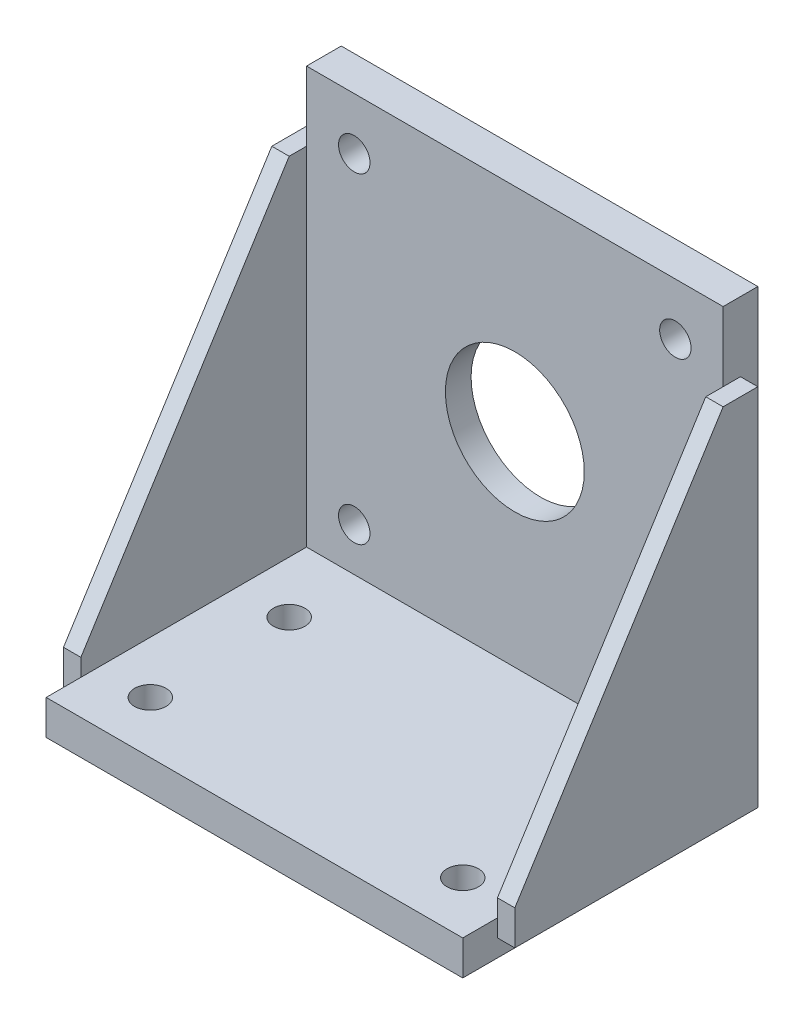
ISO-10303-21;
HEADER;
FILE_DESCRIPTION(('STEP AP214'),'2;1');
FILE_NAME('part.step','',(''),(''),'','','');
FILE_SCHEMA(('AUTOMOTIVE_DESIGN { 1 0 10303 214 1 1 1 1 }'));
ENDSEC;
DATA;
#1=APPLICATION_CONTEXT('core data for automotive mechanical design processes');
#2=APPLICATION_PROTOCOL_DEFINITION('international standard','automotive_design',2000,#1);
#3=PRODUCT_CONTEXT('',#1,'mechanical');
#4=PRODUCT('Part','Part','',(#3));
#5=PRODUCT_RELATED_PRODUCT_CATEGORY('part','',(#4));
#6=PRODUCT_DEFINITION_FORMATION('','',#4);
#7=PRODUCT_DEFINITION_CONTEXT('part definition',#1,'design');
#8=PRODUCT_DEFINITION('design','',#6,#7);
#9=PRODUCT_DEFINITION_SHAPE('','',#8);
#10=(LENGTH_UNIT() NAMED_UNIT(*) SI_UNIT(.MILLI.,.METRE.));
#11=(NAMED_UNIT(*) PLANE_ANGLE_UNIT() SI_UNIT($,.RADIAN.));
#12=(NAMED_UNIT(*) SI_UNIT($,.STERADIAN.) SOLID_ANGLE_UNIT());
#13=UNCERTAINTY_MEASURE_WITH_UNIT(LENGTH_MEASURE(1.E-05),#10,'distance_accuracy_value','');
#14=(GEOMETRIC_REPRESENTATION_CONTEXT(3) GLOBAL_UNCERTAINTY_ASSIGNED_CONTEXT((#13)) GLOBAL_UNIT_ASSIGNED_CONTEXT((#10,
#11,#12)) REPRESENTATION_CONTEXT('',''));
#15=CARTESIAN_POINT('',(0.,0.,0.));
#16=DIRECTION('',(0.,0.,1.));
#17=DIRECTION('',(1.,0.,0.));
#18=AXIS2_PLACEMENT_3D('',#15,#16,#17);
#19=CARTESIAN_POINT('',(-76.2,77.7875,12.7));
#20=DIRECTION('',(1.,0.,0.));
#21=DIRECTION('',(0.,1.,0.));
#22=AXIS2_PLACEMENT_3D('',#19,#20,#21);
#23=PLANE('',#22);
#24=DIRECTION('',(0.,0.,1.));
#25=VECTOR('',#24,1.);
#26=CARTESIAN_POINT('',(-76.2,-74.6125,6.35));
#27=LINE('',#26,#25);
#28=CARTESIAN_POINT('',(-76.2,-74.6125,95.25));
#29=VERTEX_POINT('',#28);
#30=CARTESIAN_POINT('',(-76.2,-74.6125,107.95));
#31=VERTEX_POINT('',#30);
#32=EDGE_CURVE('E211',#29,#31,#27,.T.);
#33=ORIENTED_EDGE('',*,*,#32,.F.);
#34=DIRECTION('',(0.,-1.,0.));
#35=VECTOR('',#34,1.);
#36=CARTESIAN_POINT('',(-76.2,-68.2625,95.25));
#37=LINE('',#36,#35);
#38=CARTESIAN_POINT('',(-76.2,-80.9625,95.25));
#39=VERTEX_POINT('',#38);
#40=EDGE_CURVE('E189',#29,#39,#37,.T.);
#41=ORIENTED_EDGE('',*,*,#40,.T.);
#42=DIRECTION('',(0.,0.,1.));
#43=VECTOR('',#42,1.);
#44=CARTESIAN_POINT('',(-76.2,-80.9625,6.35));
#45=LINE('',#44,#43);
#46=CARTESIAN_POINT('',(-76.2,-80.9625,6.35));
#47=VERTEX_POINT('',#46);
#48=EDGE_CURVE('E174',#47,#39,#45,.T.);
#49=ORIENTED_EDGE('',*,*,#48,.F.);
#50=DIRECTION('',(0.,-1.,0.));
#51=VECTOR('',#50,1.);
#52=CARTESIAN_POINT('',(-76.2,-74.6125,6.35));
#53=LINE('',#52,#51);
#54=CARTESIAN_POINT('',(-76.2,-87.3125,6.35));
#55=VERTEX_POINT('',#54);
#56=EDGE_CURVE('E187',#47,#55,#53,.T.);
#57=ORIENTED_EDGE('',*,*,#56,.T.);
#58=DIRECTION('',(0.,0.,-1.));
#59=VECTOR('',#58,1.);
#60=CARTESIAN_POINT('',(-76.2,-87.3125,107.95));
#61=LINE('',#60,#59);
#62=CARTESIAN_POINT('',(-76.2,-87.3125,107.95));
#63=VERTEX_POINT('',#62);
#64=EDGE_CURVE('E197',#63,#55,#61,.T.);
#65=ORIENTED_EDGE('',*,*,#64,.F.);
#66=DIRECTION('',(0.,1.,0.));
#67=VECTOR('',#66,1.);
#68=CARTESIAN_POINT('',(-76.2,-87.3125,107.95));
#69=LINE('',#68,#67);
#70=EDGE_CURVE('E200',#63,#31,#69,.T.);
#71=ORIENTED_EDGE('',*,*,#70,.T.);
#72=EDGE_LOOP('',(#33,#41,#49,#57,#65,#71));
#73=FACE_BOUND('',#72,.T.);
#74=ADVANCED_FACE('F32',(#73),#23,.F.);
#75=CARTESIAN_POINT('',(76.2,-74.6125,12.7));
#76=DIRECTION('',(-1.,0.,0.));
#77=DIRECTION('',(0.,0.,1.));
#78=AXIS2_PLACEMENT_3D('',#75,#76,#77);
#79=PLANE('',#78);
#80=DIRECTION('',(0.,0.,1.));
#81=VECTOR('',#80,1.);
#82=CARTESIAN_POINT('',(76.2,52.3875,6.35));
#83=LINE('',#82,#81);
#84=CARTESIAN_POINT('',(76.2,52.3875,6.35));
#85=VERTEX_POINT('',#84);
#86=CARTESIAN_POINT('',(76.2,52.3875,12.7));
#87=VERTEX_POINT('',#86);
#88=EDGE_CURVE('E55',#85,#87,#83,.T.);
#89=ORIENTED_EDGE('',*,*,#88,.F.);
#90=DIRECTION('',(0.,1.,0.));
#91=VECTOR('',#90,1.);
#92=CARTESIAN_POINT('',(76.2,-80.9625,6.35));
#93=LINE('',#92,#91);
#94=CARTESIAN_POINT('',(76.2,-74.6125,6.35));
#95=VERTEX_POINT('',#94);
#96=EDGE_CURVE('E235',#95,#85,#93,.T.);
#97=ORIENTED_EDGE('',*,*,#96,.F.);
#98=DIRECTION('',(0.,0.,-1.));
#99=VECTOR('',#98,1.);
#100=CARTESIAN_POINT('',(76.2,-74.6125,12.7));
#101=LINE('',#100,#99);
#102=CARTESIAN_POINT('',(76.2,-74.6125,0.));
#103=VERTEX_POINT('',#102);
#104=EDGE_CURVE('E320',#95,#103,#101,.T.);
#105=ORIENTED_EDGE('',*,*,#104,.T.);
#106=DIRECTION('',(0.,1.,0.));
#107=VECTOR('',#106,1.);
#108=CARTESIAN_POINT('',(76.2,-74.6125,0.));
#109=LINE('',#108,#107);
#110=CARTESIAN_POINT('',(76.2,77.7875,0.));
#111=VERTEX_POINT('',#110);
#112=EDGE_CURVE('E426',#103,#111,#109,.T.);
#113=ORIENTED_EDGE('',*,*,#112,.T.);
#114=DIRECTION('',(0.,0.,-1.));
#115=VECTOR('',#114,1.);
#116=CARTESIAN_POINT('',(76.2,77.7875,12.7));
#117=LINE('',#116,#115);
#118=CARTESIAN_POINT('',(76.2,77.7875,12.7));
#119=VERTEX_POINT('',#118);
#120=EDGE_CURVE('E419',#119,#111,#117,.T.);
#121=ORIENTED_EDGE('',*,*,#120,.F.);
#122=DIRECTION('',(0.,1.,0.));
#123=VECTOR('',#122,1.);
#124=CARTESIAN_POINT('',(76.2,-74.6125,12.7));
#125=LINE('',#124,#123);
#126=EDGE_CURVE('E348',#87,#119,#125,.T.);
#127=ORIENTED_EDGE('',*,*,#126,.F.);
#128=EDGE_LOOP('',(#89,#97,#105,#113,#121,#127));
#129=FACE_BOUND('',#128,.T.);
#130=ADVANCED_FACE('F292',(#129),#79,.F.);
#131=CARTESIAN_POINT('',(76.2,77.7875,12.7));
#132=DIRECTION('',(0.,-1.,0.));
#133=DIRECTION('',(1.,0.,0.));
#134=AXIS2_PLACEMENT_3D('',#131,#132,#133);
#135=PLANE('',#134);
#136=DIRECTION('',(-1.,0.,0.));
#137=VECTOR('',#136,1.);
#138=CARTESIAN_POINT('',(76.2,77.7875,0.));
#139=LINE('',#138,#137);
#140=CARTESIAN_POINT('',(-76.2,77.7875,0.));
#141=VERTEX_POINT('',#140);
#142=EDGE_CURVE('E337',#111,#141,#139,.T.);
#143=ORIENTED_EDGE('',*,*,#142,.T.);
#144=DIRECTION('',(0.,0.,-1.));
#145=VECTOR('',#144,1.);
#146=CARTESIAN_POINT('',(-76.2,77.7875,12.7));
#147=LINE('',#146,#145);
#148=CARTESIAN_POINT('',(-76.2,77.7875,12.7));
#149=VERTEX_POINT('',#148);
#150=EDGE_CURVE('E411',#149,#141,#147,.T.);
#151=ORIENTED_EDGE('',*,*,#150,.F.);
#152=DIRECTION('',(-1.,0.,0.));
#153=VECTOR('',#152,1.);
#154=CARTESIAN_POINT('',(76.2,77.7875,12.7));
#155=LINE('',#154,#153);
#156=EDGE_CURVE('E231',#119,#149,#155,.T.);
#157=ORIENTED_EDGE('',*,*,#156,.F.);
#158=ORIENTED_EDGE('',*,*,#120,.T.);
#159=EDGE_LOOP('',(#143,#151,#157,#158));
#160=FACE_BOUND('',#159,.T.);
#161=ADVANCED_FACE('F299',(#160),#135,.F.);
#162=DIRECTION('',(0.,1.,0.));
#163=VECTOR('',#162,1.);
#164=CARTESIAN_POINT('',(-76.2,-80.9625,6.35));
#165=LINE('',#164,#163);
#166=CARTESIAN_POINT('',(-76.2,-74.6125,6.35));
#167=VERTEX_POINT('',#166);
#168=CARTESIAN_POINT('',(-76.2,52.3875,6.35));
#169=VERTEX_POINT('',#168);
#170=EDGE_CURVE('E232',#167,#169,#165,.T.);
#171=ORIENTED_EDGE('',*,*,#170,.T.);
#172=DIRECTION('',(0.,0.,1.));
#173=VECTOR('',#172,1.);
#174=CARTESIAN_POINT('',(-76.2,52.3875,6.35));
#175=LINE('',#174,#173);
#176=CARTESIAN_POINT('',(-76.2,52.3875,12.7));
#177=VERTEX_POINT('',#176);
#178=EDGE_CURVE('E47',#169,#177,#175,.T.);
#179=ORIENTED_EDGE('',*,*,#178,.T.);
#180=DIRECTION('',(0.,-1.,0.));
#181=VECTOR('',#180,1.);
#182=CARTESIAN_POINT('',(-76.2,77.7875,12.7));
#183=LINE('',#182,#181);
#184=EDGE_CURVE('E219',#149,#177,#183,.T.);
#185=ORIENTED_EDGE('',*,*,#184,.F.);
#186=ORIENTED_EDGE('',*,*,#150,.T.);
#187=DIRECTION('',(0.,-1.,0.));
#188=VECTOR('',#187,1.);
#189=CARTESIAN_POINT('',(-76.2,77.7875,0.));
#190=LINE('',#189,#188);
#191=CARTESIAN_POINT('',(-76.2,-74.6125,0.));
#192=VERTEX_POINT('',#191);
#193=EDGE_CURVE('E413',#141,#192,#190,.T.);
#194=ORIENTED_EDGE('',*,*,#193,.T.);
#195=DIRECTION('',(0.,0.,-1.));
#196=VECTOR('',#195,1.);
#197=CARTESIAN_POINT('',(-76.2,-74.6125,12.7));
#198=LINE('',#197,#196);
#199=EDGE_CURVE('E315',#167,#192,#198,.T.);
#200=ORIENTED_EDGE('',*,*,#199,.F.);
#201=EDGE_LOOP('',(#171,#179,#185,#186,#194,#200));
#202=FACE_BOUND('',#201,.T.);
#203=ADVANCED_FACE('F294',(#202),#23,.F.);
#204=CARTESIAN_POINT('',(76.2,-74.6125,12.7));
#205=DIRECTION('',(0.,-1.,0.));
#206=DIRECTION('',(1.,0.,0.));
#207=AXIS2_PLACEMENT_3D('',#204,#205,#206);
#208=PLANE('',#207);
#209=DIRECTION('',(1.,0.,0.));
#210=VECTOR('',#209,1.);
#211=CARTESIAN_POINT('',(-76.2,-74.6125,6.35));
#212=LINE('',#211,#210);
#213=EDGE_CURVE('E317',#167,#95,#212,.T.);
#214=ORIENTED_EDGE('',*,*,#213,.F.);
#215=ORIENTED_EDGE('',*,*,#199,.T.);
#216=DIRECTION('',(-1.,0.,0.));
#217=VECTOR('',#216,1.);
#218=CARTESIAN_POINT('',(76.2,-74.6125,0.));
#219=LINE('',#218,#217);
#220=EDGE_CURVE('E422',#103,#192,#219,.T.);
#221=ORIENTED_EDGE('',*,*,#220,.F.);
#222=ORIENTED_EDGE('',*,*,#104,.F.);
#223=EDGE_LOOP('',(#214,#215,#221,#222));
#224=FACE_BOUND('',#223,.T.);
#225=ADVANCED_FACE('F305',(#224),#208,.T.);
#226=DIRECTION('',(0.,-1.,0.));
#227=VECTOR('',#226,1.);
#228=CARTESIAN_POINT('',(76.2,-74.6125,6.35));
#229=LINE('',#228,#227);
#230=CARTESIAN_POINT('',(76.2,-80.9625,6.35));
#231=VERTEX_POINT('',#230);
#232=CARTESIAN_POINT('',(76.2,-87.3125,6.35));
#233=VERTEX_POINT('',#232);
#234=EDGE_CURVE('E350',#231,#233,#229,.T.);
#235=ORIENTED_EDGE('',*,*,#234,.F.);
#236=DIRECTION('',(0.,0.,1.));
#237=VECTOR('',#236,1.);
#238=CARTESIAN_POINT('',(76.2,-80.9625,6.35));
#239=LINE('',#238,#237);
#240=CARTESIAN_POINT('',(76.2,-80.9625,95.25));
#241=VERTEX_POINT('',#240);
#242=EDGE_CURVE('E208',#231,#241,#239,.T.);
#243=ORIENTED_EDGE('',*,*,#242,.T.);
#244=DIRECTION('',(0.,-1.,0.));
#245=VECTOR('',#244,1.);
#246=CARTESIAN_POINT('',(76.2,-68.2625,95.25));
#247=LINE('',#246,#245);
#248=CARTESIAN_POINT('',(76.2,-74.6125,95.25));
#249=VERTEX_POINT('',#248);
#250=EDGE_CURVE('E356',#249,#241,#247,.T.);
#251=ORIENTED_EDGE('',*,*,#250,.F.);
#252=DIRECTION('',(0.,0.,1.));
#253=VECTOR('',#252,1.);
#254=CARTESIAN_POINT('',(76.2,-74.6125,6.35));
#255=LINE('',#254,#253);
#256=CARTESIAN_POINT('',(76.2,-74.6125,107.95));
#257=VERTEX_POINT('',#256);
#258=EDGE_CURVE('E203',#249,#257,#255,.T.);
#259=ORIENTED_EDGE('',*,*,#258,.T.);
#260=DIRECTION('',(0.,1.,0.));
#261=VECTOR('',#260,1.);
#262=CARTESIAN_POINT('',(76.2,-87.3125,107.95));
#263=LINE('',#262,#261);
#264=CARTESIAN_POINT('',(76.2,-87.3125,107.95));
#265=VERTEX_POINT('',#264);
#266=EDGE_CURVE('E342',#265,#257,#263,.T.);
#267=ORIENTED_EDGE('',*,*,#266,.F.);
#268=DIRECTION('',(0.,0.,-1.));
#269=VECTOR('',#268,1.);
#270=CARTESIAN_POINT('',(76.2,-87.3125,107.95));
#271=LINE('',#270,#269);
#272=EDGE_CURVE('E352',#265,#233,#271,.T.);
#273=ORIENTED_EDGE('',*,*,#272,.T.);
#274=EDGE_LOOP('',(#235,#243,#251,#259,#267,#273));
#275=FACE_BOUND('',#274,.T.);
#276=ADVANCED_FACE('F301',(#275),#79,.F.);
#277=CARTESIAN_POINT('',(-76.2,77.7875,12.7));
#278=DIRECTION('',(0.,0.,1.));
#279=DIRECTION('',(1.,0.,0.));
#280=AXIS2_PLACEMENT_3D('',#277,#278,#279);
#281=PLANE('',#280);
#282=CARTESIAN_POINT('',(58.7375,-58.7375,12.7));
#283=DIRECTION('',(0.,0.,1.));
#284=DIRECTION('',(1.,0.,0.));
#285=AXIS2_PLACEMENT_3D('',#282,#283,#284);
#286=CIRCLE('',#285,5.75436999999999);
#287=CARTESIAN_POINT('',(64.49187,-58.7375,12.7));
#288=VERTEX_POINT('',#287);
#289=EDGE_CURVE('E262',#288,#288,#286,.T.);
#290=ORIENTED_EDGE('',*,*,#289,.F.);
#291=EDGE_LOOP('',(#290));
#292=FACE_BOUND('',#291,.T.);
#293=CARTESIAN_POINT('',(58.7375,58.7375,12.7));
#294=DIRECTION('',(0.,0.,1.));
#295=DIRECTION('',(1.,0.,0.));
#296=AXIS2_PLACEMENT_3D('',#293,#294,#295);
#297=CIRCLE('',#296,5.75436999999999);
#298=CARTESIAN_POINT('',(64.49187,58.7375,12.7));
#299=VERTEX_POINT('',#298);
#300=EDGE_CURVE('E258',#299,#299,#297,.T.);
#301=ORIENTED_EDGE('',*,*,#300,.F.);
#302=EDGE_LOOP('',(#301));
#303=FACE_BOUND('',#302,.T.);
#304=CARTESIAN_POINT('',(-58.7375,58.7375,12.7));
#305=DIRECTION('',(0.,0.,1.));
#306=DIRECTION('',(1.,0.,0.));
#307=AXIS2_PLACEMENT_3D('',#304,#305,#306);
#308=CIRCLE('',#307,5.75436999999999);
#309=CARTESIAN_POINT('',(-52.98313,58.7375,12.7));
#310=VERTEX_POINT('',#309);
#311=EDGE_CURVE('E254',#310,#310,#308,.T.);
#312=ORIENTED_EDGE('',*,*,#311,.F.);
#313=EDGE_LOOP('',(#312));
#314=FACE_BOUND('',#313,.T.);
#315=CARTESIAN_POINT('',(-58.7375,-58.7375,12.7));
#316=DIRECTION('',(0.,0.,1.));
#317=DIRECTION('',(1.,0.,0.));
#318=AXIS2_PLACEMENT_3D('',#315,#316,#317);
#319=CIRCLE('',#318,5.75436999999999);
#320=CARTESIAN_POINT('',(-52.98313,-58.7375,12.7));
#321=VERTEX_POINT('',#320);
#322=EDGE_CURVE('E250',#321,#321,#319,.T.);
#323=ORIENTED_EDGE('',*,*,#322,.F.);
#324=EDGE_LOOP('',(#323));
#325=FACE_BOUND('',#324,.T.);
#326=CARTESIAN_POINT('',(0.,0.,12.7));
#327=DIRECTION('',(0.,0.,1.));
#328=DIRECTION('',(1.,0.,0.));
#329=AXIS2_PLACEMENT_3D('',#326,#327,#328);
#330=CIRCLE('',#329,25.4);
#331=CARTESIAN_POINT('',(25.4,0.,12.7));
#332=VERTEX_POINT('',#331);
#333=EDGE_CURVE('E698',#332,#332,#330,.T.);
#334=ORIENTED_EDGE('',*,*,#333,.F.);
#335=EDGE_LOOP('',(#334));
#336=FACE_BOUND('',#335,.T.);
#337=ORIENTED_EDGE('',*,*,#156,.T.);
#338=ORIENTED_EDGE('',*,*,#184,.T.);
#339=CARTESIAN_POINT('',(-76.2,-74.6124999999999,12.7));
#340=VERTEX_POINT('',#339);
#341=EDGE_CURVE('E223',#177,#340,#183,.T.);
#342=ORIENTED_EDGE('',*,*,#341,.T.);
#343=DIRECTION('',(-1.,0.,0.));
#344=VECTOR('',#343,1.);
#345=CARTESIAN_POINT('',(76.2,-74.6125,12.7));
#346=LINE('',#345,#344);
#347=CARTESIAN_POINT('',(76.2,-74.6125,12.7));
#348=VERTEX_POINT('',#347);
#349=EDGE_CURVE('E222',#348,#340,#346,.T.);
#350=ORIENTED_EDGE('',*,*,#349,.F.);
#351=EDGE_CURVE('E431',#348,#87,#125,.T.);
#352=ORIENTED_EDGE('',*,*,#351,.T.);
#353=ORIENTED_EDGE('',*,*,#126,.T.);
#354=EDGE_LOOP('',(#337,#338,#342,#350,#352,#353));
#355=FACE_BOUND('',#354,.T.);
#356=ADVANCED_FACE('F406',(#292,#303,#314,#325,#336,#355),#281,.T.);
#357=CARTESIAN_POINT('',(-76.2,77.7875,0.));
#358=DIRECTION('',(0.,0.,1.));
#359=DIRECTION('',(1.,0.,0.));
#360=AXIS2_PLACEMENT_3D('',#357,#358,#359);
#361=PLANE('',#360);
#362=CARTESIAN_POINT('',(58.7375,-58.7375,0.));
#363=DIRECTION('',(0.,0.,1.));
#364=DIRECTION('',(1.,0.,0.));
#365=AXIS2_PLACEMENT_3D('',#362,#363,#364);
#366=CIRCLE('',#365,5.75436999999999);
#367=CARTESIAN_POINT('',(64.49187,-58.7375,0.));
#368=VERTEX_POINT('',#367);
#369=EDGE_CURVE('E259',#368,#368,#366,.T.);
#370=ORIENTED_EDGE('',*,*,#369,.T.);
#371=EDGE_LOOP('',(#370));
#372=FACE_BOUND('',#371,.T.);
#373=CARTESIAN_POINT('',(58.7375,58.7375,0.));
#374=DIRECTION('',(0.,0.,1.));
#375=DIRECTION('',(1.,0.,0.));
#376=AXIS2_PLACEMENT_3D('',#373,#374,#375);
#377=CIRCLE('',#376,5.75436999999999);
#378=CARTESIAN_POINT('',(64.49187,58.7375,0.));
#379=VERTEX_POINT('',#378);
#380=EDGE_CURVE('E255',#379,#379,#377,.T.);
#381=ORIENTED_EDGE('',*,*,#380,.T.);
#382=EDGE_LOOP('',(#381));
#383=FACE_BOUND('',#382,.T.);
#384=CARTESIAN_POINT('',(-58.7375,58.7375,0.));
#385=DIRECTION('',(0.,0.,1.));
#386=DIRECTION('',(1.,0.,0.));
#387=AXIS2_PLACEMENT_3D('',#384,#385,#386);
#388=CIRCLE('',#387,5.75436999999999);
#389=CARTESIAN_POINT('',(-52.98313,58.7375,0.));
#390=VERTEX_POINT('',#389);
#391=EDGE_CURVE('E251',#390,#390,#388,.T.);
#392=ORIENTED_EDGE('',*,*,#391,.T.);
#393=EDGE_LOOP('',(#392));
#394=FACE_BOUND('',#393,.T.);
#395=CARTESIAN_POINT('',(-58.7375,-58.7375,0.));
#396=DIRECTION('',(0.,0.,1.));
#397=DIRECTION('',(1.,0.,0.));
#398=AXIS2_PLACEMENT_3D('',#395,#396,#397);
#399=CIRCLE('',#398,5.75436999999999);
#400=CARTESIAN_POINT('',(-52.98313,-58.7375,0.));
#401=VERTEX_POINT('',#400);
#402=EDGE_CURVE('E246',#401,#401,#399,.T.);
#403=ORIENTED_EDGE('',*,*,#402,.T.);
#404=EDGE_LOOP('',(#403));
#405=FACE_BOUND('',#404,.T.);
#406=CARTESIAN_POINT('',(0.,0.,0.));
#407=DIRECTION('',(0.,0.,-1.));
#408=DIRECTION('',(-1.,0.,0.));
#409=AXIS2_PLACEMENT_3D('',#406,#407,#408);
#410=CIRCLE('',#409,63.5635);
#411=CARTESIAN_POINT('',(-63.5635,0.,0.));
#412=VERTEX_POINT('',#411);
#413=EDGE_CURVE('E701',#412,#412,#410,.T.);
#414=ORIENTED_EDGE('',*,*,#413,.F.);
#415=EDGE_LOOP('',(#414));
#416=FACE_BOUND('',#415,.T.);
#417=ORIENTED_EDGE('',*,*,#142,.F.);
#418=ORIENTED_EDGE('',*,*,#112,.F.);
#419=ORIENTED_EDGE('',*,*,#220,.T.);
#420=ORIENTED_EDGE('',*,*,#193,.F.);
#421=EDGE_LOOP('',(#417,#418,#419,#420));
#422=FACE_BOUND('',#421,.T.);
#423=ADVANCED_FACE('F287',(#372,#383,#394,#405,#416,#422),#361,.F.);
#424=CARTESIAN_POINT('',(-76.2,-74.6125,6.35));
#425=DIRECTION('',(0.,0.,1.));
#426=DIRECTION('',(0.,-1.,0.));
#427=AXIS2_PLACEMENT_3D('',#424,#425,#426);
#428=PLANE('',#427);
#429=ORIENTED_EDGE('',*,*,#213,.T.);
#430=ORIENTED_EDGE('',*,*,#96,.T.);
#431=DIRECTION('',(-1.,0.,0.));
#432=VECTOR('',#431,1.);
#433=CARTESIAN_POINT('',(82.55,52.3875,6.35));
#434=LINE('',#433,#432);
#435=CARTESIAN_POINT('',(82.55,52.3875,6.35));
#436=VERTEX_POINT('',#435);
#437=EDGE_CURVE('E374',#436,#85,#434,.T.);
#438=ORIENTED_EDGE('',*,*,#437,.F.);
#439=DIRECTION('',(0.,1.,0.));
#440=VECTOR('',#439,1.);
#441=CARTESIAN_POINT('',(82.55,-80.9625,6.35));
#442=LINE('',#441,#440);
#443=CARTESIAN_POINT('',(82.55,-80.9625,6.35));
#444=VERTEX_POINT('',#443);
#445=EDGE_CURVE('E372',#444,#436,#442,.T.);
#446=ORIENTED_EDGE('',*,*,#445,.F.);
#447=DIRECTION('',(-1.,0.,0.));
#448=VECTOR('',#447,1.);
#449=CARTESIAN_POINT('',(82.55,-80.9625,6.35));
#450=LINE('',#449,#448);
#451=EDGE_CURVE('E357',#444,#231,#450,.T.);
#452=ORIENTED_EDGE('',*,*,#451,.T.);
#453=ORIENTED_EDGE('',*,*,#234,.T.);
#454=DIRECTION('',(1.,0.,0.));
#455=VECTOR('',#454,1.);
#456=CARTESIAN_POINT('',(-76.2,-87.3125,6.35));
#457=LINE('',#456,#455);
#458=EDGE_CURVE('E195',#55,#233,#457,.T.);
#459=ORIENTED_EDGE('',*,*,#458,.F.);
#460=ORIENTED_EDGE('',*,*,#56,.F.);
#461=DIRECTION('',(1.,0.,0.));
#462=VECTOR('',#461,1.);
#463=CARTESIAN_POINT('',(-82.55,-80.9625,6.35));
#464=LINE('',#463,#462);
#465=CARTESIAN_POINT('',(-82.55,-80.9625,6.35));
#466=VERTEX_POINT('',#465);
#467=EDGE_CURVE('E170',#466,#47,#464,.T.);
#468=ORIENTED_EDGE('',*,*,#467,.F.);
#469=DIRECTION('',(0.,1.,0.));
#470=VECTOR('',#469,1.);
#471=CARTESIAN_POINT('',(-82.55,-80.9625,6.35));
#472=LINE('',#471,#470);
#473=CARTESIAN_POINT('',(-82.55,52.3875,6.35));
#474=VERTEX_POINT('',#473);
#475=EDGE_CURVE('E720',#466,#474,#472,.T.);
#476=ORIENTED_EDGE('',*,*,#475,.T.);
#477=DIRECTION('',(1.,0.,0.));
#478=VECTOR('',#477,1.);
#479=CARTESIAN_POINT('',(-82.55,52.3875,6.35));
#480=LINE('',#479,#478);
#481=EDGE_CURVE('E181',#474,#169,#480,.T.);
#482=ORIENTED_EDGE('',*,*,#481,.T.);
#483=ORIENTED_EDGE('',*,*,#170,.F.);
#484=EDGE_LOOP('',(#429,#430,#438,#446,#452,#453,#459,#460,#468,#476,#482,#483));
#485=FACE_BOUND('',#484,.T.);
#486=ADVANCED_FACE('F193',(#485),#428,.F.);
#487=CARTESIAN_POINT('',(-76.2,-87.3125,107.95));
#488=DIRECTION('',(0.,-1.,0.));
#489=DIRECTION('',(0.,0.,-1.));
#490=AXIS2_PLACEMENT_3D('',#487,#488,#489);
#491=PLANE('',#490);
#492=CARTESIAN_POINT('',(57.15,-87.3125,88.9));
#493=DIRECTION('',(0.,-1.,0.));
#494=DIRECTION('',(0.,0.,-1.));
#495=AXIS2_PLACEMENT_3D('',#492,#493,#494);
#496=CIRCLE('',#495,5.75436999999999);
#497=CARTESIAN_POINT('',(57.15,-87.3125,83.14563));
#498=VERTEX_POINT('',#497);
#499=EDGE_CURVE('E675',#498,#498,#496,.T.);
#500=ORIENTED_EDGE('',*,*,#499,.F.);
#501=EDGE_LOOP('',(#500));
#502=FACE_BOUND('',#501,.T.);
#503=CARTESIAN_POINT('',(-57.15,-87.3125,88.9));
#504=DIRECTION('',(0.,-1.,0.));
#505=DIRECTION('',(0.,0.,-1.));
#506=AXIS2_PLACEMENT_3D('',#503,#504,#505);
#507=CIRCLE('',#506,5.75436999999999);
#508=CARTESIAN_POINT('',(-57.15,-87.3125,83.14563));
#509=VERTEX_POINT('',#508);
#510=EDGE_CURVE('E682',#509,#509,#507,.T.);
#511=ORIENTED_EDGE('',*,*,#510,.F.);
#512=EDGE_LOOP('',(#511));
#513=FACE_BOUND('',#512,.T.);
#514=ORIENTED_EDGE('',*,*,#272,.F.);
#515=DIRECTION('',(1.,0.,0.));
#516=VECTOR('',#515,1.);
#517=CARTESIAN_POINT('',(-76.2,-87.3125,107.95));
#518=LINE('',#517,#516);
#519=EDGE_CURVE('E324',#63,#265,#518,.T.);
#520=ORIENTED_EDGE('',*,*,#519,.F.);
#521=ORIENTED_EDGE('',*,*,#64,.T.);
#522=ORIENTED_EDGE('',*,*,#458,.T.);
#523=EDGE_LOOP('',(#514,#520,#521,#522));
#524=FACE_BOUND('',#523,.T.);
#525=CARTESIAN_POINT('',(-57.15,-87.3125,38.1));
#526=DIRECTION('',(0.,-1.,0.));
#527=DIRECTION('',(0.,0.,-1.));
#528=AXIS2_PLACEMENT_3D('',#525,#526,#527);
#529=CIRCLE('',#528,5.75436999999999);
#530=CARTESIAN_POINT('',(-57.15,-87.3125,32.34563));
#531=VERTEX_POINT('',#530);
#532=EDGE_CURVE('E263',#531,#531,#529,.T.);
#533=ORIENTED_EDGE('',*,*,#532,.F.);
#534=EDGE_LOOP('',(#533));
#535=FACE_BOUND('',#534,.T.);
#536=CARTESIAN_POINT('',(57.1499999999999,-87.3125,38.1));
#537=DIRECTION('',(0.,-1.,0.));
#538=DIRECTION('',(0.,0.,-1.));
#539=AXIS2_PLACEMENT_3D('',#536,#537,#538);
#540=CIRCLE('',#539,5.75436999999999);
#541=CARTESIAN_POINT('',(57.1499999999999,-87.3125,32.34563));
#542=VERTEX_POINT('',#541);
#543=EDGE_CURVE('E40',#542,#542,#540,.T.);
#544=ORIENTED_EDGE('',*,*,#543,.F.);
#545=EDGE_LOOP('',(#544));
#546=FACE_BOUND('',#545,.T.);
#547=ADVANCED_FACE('F273',(#502,#513,#524,#535,#546),#491,.T.);
#548=CARTESIAN_POINT('',(-76.2,-87.3125,107.95));
#549=DIRECTION('',(0.,0.,-1.));
#550=DIRECTION('',(-1.,0.,0.));
#551=AXIS2_PLACEMENT_3D('',#548,#549,#550);
#552=PLANE('',#551);
#553=ORIENTED_EDGE('',*,*,#266,.T.);
#554=DIRECTION('',(1.,0.,0.));
#555=VECTOR('',#554,1.);
#556=CARTESIAN_POINT('',(-76.2,-74.6125,107.95));
#557=LINE('',#556,#555);
#558=EDGE_CURVE('E321',#31,#257,#557,.T.);
#559=ORIENTED_EDGE('',*,*,#558,.F.);
#560=ORIENTED_EDGE('',*,*,#70,.F.);
#561=ORIENTED_EDGE('',*,*,#519,.T.);
#562=EDGE_LOOP('',(#553,#559,#560,#561));
#563=FACE_BOUND('',#562,.T.);
#564=ADVANCED_FACE('F275',(#563),#552,.F.);
#565=CARTESIAN_POINT('',(-76.2,-74.6125,6.35));
#566=DIRECTION('',(0.,1.,0.));
#567=DIRECTION('',(0.,0.,1.));
#568=AXIS2_PLACEMENT_3D('',#565,#566,#567);
#569=PLANE('',#568);
#570=CARTESIAN_POINT('',(57.15,-74.6125,88.9));
#571=DIRECTION('',(0.,1.,0.));
#572=DIRECTION('',(0.,0.,1.));
#573=AXIS2_PLACEMENT_3D('',#570,#571,#572);
#574=CIRCLE('',#573,5.75436999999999);
#575=CARTESIAN_POINT('',(57.15,-74.6125,94.65437));
#576=VERTEX_POINT('',#575);
#577=EDGE_CURVE('E678',#576,#576,#574,.T.);
#578=ORIENTED_EDGE('',*,*,#577,.F.);
#579=EDGE_LOOP('',(#578));
#580=FACE_BOUND('',#579,.T.);
#581=CARTESIAN_POINT('',(-57.15,-74.6125,88.9));
#582=DIRECTION('',(0.,1.,0.));
#583=DIRECTION('',(0.,0.,1.));
#584=AXIS2_PLACEMENT_3D('',#581,#582,#583);
#585=CIRCLE('',#584,5.75436999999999);
#586=CARTESIAN_POINT('',(-57.15,-74.6125,94.65437));
#587=VERTEX_POINT('',#586);
#588=EDGE_CURVE('E679',#587,#587,#585,.T.);
#589=ORIENTED_EDGE('',*,*,#588,.F.);
#590=EDGE_LOOP('',(#589));
#591=FACE_BOUND('',#590,.T.);
#592=EDGE_CURVE('E198',#348,#249,#255,.T.);
#593=ORIENTED_EDGE('',*,*,#592,.F.);
#594=ORIENTED_EDGE('',*,*,#349,.T.);
#595=EDGE_CURVE('E322',#340,#29,#27,.T.);
#596=ORIENTED_EDGE('',*,*,#595,.T.);
#597=ORIENTED_EDGE('',*,*,#32,.T.);
#598=ORIENTED_EDGE('',*,*,#558,.T.);
#599=ORIENTED_EDGE('',*,*,#258,.F.);
#600=EDGE_LOOP('',(#593,#594,#596,#597,#598,#599));
#601=FACE_BOUND('',#600,.T.);
#602=CARTESIAN_POINT('',(-57.15,-74.6124999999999,38.1));
#603=DIRECTION('',(0.,1.,0.));
#604=DIRECTION('',(0.,0.,1.));
#605=AXIS2_PLACEMENT_3D('',#602,#603,#604);
#606=CIRCLE('',#605,5.75436999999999);
#607=CARTESIAN_POINT('',(-57.15,-74.6124999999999,43.85437));
#608=VERTEX_POINT('',#607);
#609=EDGE_CURVE('E266',#608,#608,#606,.T.);
#610=ORIENTED_EDGE('',*,*,#609,.F.);
#611=EDGE_LOOP('',(#610));
#612=FACE_BOUND('',#611,.T.);
#613=CARTESIAN_POINT('',(57.1499999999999,-74.6124999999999,38.1));
#614=DIRECTION('',(0.,1.,0.));
#615=DIRECTION('',(0.,0.,1.));
#616=AXIS2_PLACEMENT_3D('',#613,#614,#615);
#617=CIRCLE('',#616,5.75436999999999);
#618=CARTESIAN_POINT('',(57.1499999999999,-74.6124999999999,43.85437));
#619=VERTEX_POINT('',#618);
#620=EDGE_CURVE('E11',#619,#619,#617,.T.);
#621=ORIENTED_EDGE('',*,*,#620,.F.);
#622=EDGE_LOOP('',(#621));
#623=FACE_BOUND('',#622,.T.);
#624=ADVANCED_FACE('F283',(#580,#591,#601,#612,#623),#569,.T.);
#625=CARTESIAN_POINT('',(82.55,52.3875,6.35));
#626=DIRECTION('',(0.,-1.,0.));
#627=DIRECTION('',(0.,0.,-1.));
#628=AXIS2_PLACEMENT_3D('',#625,#626,#627);
#629=PLANE('',#628);
#630=ORIENTED_EDGE('',*,*,#88,.T.);
#631=CARTESIAN_POINT('',(76.2,52.3875,19.05));
#632=VERTEX_POINT('',#631);
#633=EDGE_CURVE('E732',#87,#632,#83,.T.);
#634=ORIENTED_EDGE('',*,*,#633,.T.);
#635=DIRECTION('',(-1.,0.,0.));
#636=VECTOR('',#635,1.);
#637=CARTESIAN_POINT('',(82.55,52.3875,19.05));
#638=LINE('',#637,#636);
#639=CARTESIAN_POINT('',(82.55,52.3875,19.05));
#640=VERTEX_POINT('',#639);
#641=EDGE_CURVE('E353',#640,#632,#638,.T.);
#642=ORIENTED_EDGE('',*,*,#641,.F.);
#643=DIRECTION('',(0.,0.,1.));
#644=VECTOR('',#643,1.);
#645=CARTESIAN_POINT('',(82.55,52.3875,6.35));
#646=LINE('',#645,#644);
#647=EDGE_CURVE('E362',#436,#640,#646,.T.);
#648=ORIENTED_EDGE('',*,*,#647,.F.);
#649=ORIENTED_EDGE('',*,*,#437,.T.);
#650=EDGE_LOOP('',(#630,#634,#642,#648,#649));
#651=FACE_BOUND('',#650,.T.);
#652=ADVANCED_FACE('F490',(#651),#629,.F.);
#653=CARTESIAN_POINT('',(82.55,52.3875,19.05));
#654=DIRECTION('',(0.,-0.533992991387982,-0.845488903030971));
#655=DIRECTION('',(0.,0.845488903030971,-0.533992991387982));
#656=AXIS2_PLACEMENT_3D('',#653,#654,#655);
#657=PLANE('',#656);
#658=DIRECTION('',(0.,-0.845488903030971,0.533992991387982));
#659=VECTOR('',#658,1.);
#660=CARTESIAN_POINT('',(76.2,52.3875,19.05));
#661=LINE('',#660,#659);
#662=CARTESIAN_POINT('',(76.2,-68.2625,95.25));
#663=VERTEX_POINT('',#662);
#664=EDGE_CURVE('E734',#632,#663,#661,.T.);
#665=ORIENTED_EDGE('',*,*,#664,.T.);
#666=DIRECTION('',(-1.,0.,0.));
#667=VECTOR('',#666,1.);
#668=CARTESIAN_POINT('',(82.55,-68.2625,95.25));
#669=LINE('',#668,#667);
#670=CARTESIAN_POINT('',(82.55,-68.2625,95.25));
#671=VERTEX_POINT('',#670);
#672=EDGE_CURVE('E380',#671,#663,#669,.T.);
#673=ORIENTED_EDGE('',*,*,#672,.F.);
#674=DIRECTION('',(0.,-0.845488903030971,0.533992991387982));
#675=VECTOR('',#674,1.);
#676=CARTESIAN_POINT('',(82.55,52.3875,19.05));
#677=LINE('',#676,#675);
#678=EDGE_CURVE('E365',#640,#671,#677,.T.);
#679=ORIENTED_EDGE('',*,*,#678,.F.);
#680=ORIENTED_EDGE('',*,*,#641,.T.);
#681=EDGE_LOOP('',(#665,#673,#679,#680));
#682=FACE_BOUND('',#681,.T.);
#683=ADVANCED_FACE('F500',(#682),#657,.F.);
#684=CARTESIAN_POINT('',(82.55,-68.2625,95.25));
#685=DIRECTION('',(0.,0.,-1.));
#686=DIRECTION('',(-1.,0.,0.));
#687=AXIS2_PLACEMENT_3D('',#684,#685,#686);
#688=PLANE('',#687);
#689=EDGE_CURVE('E735',#663,#249,#247,.T.);
#690=ORIENTED_EDGE('',*,*,#689,.T.);
#691=ORIENTED_EDGE('',*,*,#250,.T.);
#692=DIRECTION('',(-1.,0.,0.));
#693=VECTOR('',#692,1.);
#694=CARTESIAN_POINT('',(82.55,-80.9625,95.25));
#695=LINE('',#694,#693);
#696=CARTESIAN_POINT('',(82.55,-80.9625,95.25));
#697=VERTEX_POINT('',#696);
#698=EDGE_CURVE('E377',#697,#241,#695,.T.);
#699=ORIENTED_EDGE('',*,*,#698,.F.);
#700=DIRECTION('',(0.,-1.,0.));
#701=VECTOR('',#700,1.);
#702=CARTESIAN_POINT('',(82.55,-68.2625,95.25));
#703=LINE('',#702,#701);
#704=EDGE_CURVE('E367',#671,#697,#703,.T.);
#705=ORIENTED_EDGE('',*,*,#704,.F.);
#706=ORIENTED_EDGE('',*,*,#672,.T.);
#707=EDGE_LOOP('',(#690,#691,#699,#705,#706));
#708=FACE_BOUND('',#707,.T.);
#709=ADVANCED_FACE('F508',(#708),#688,.F.);
#710=CARTESIAN_POINT('',(82.55,-80.9625,6.35));
#711=DIRECTION('',(0.,-1.,0.));
#712=DIRECTION('',(0.,0.,-1.));
#713=AXIS2_PLACEMENT_3D('',#710,#711,#712);
#714=PLANE('',#713);
#715=ORIENTED_EDGE('',*,*,#242,.F.);
#716=ORIENTED_EDGE('',*,*,#451,.F.);
#717=DIRECTION('',(0.,0.,1.));
#718=VECTOR('',#717,1.);
#719=CARTESIAN_POINT('',(82.55,-80.9625,6.35));
#720=LINE('',#719,#718);
#721=EDGE_CURVE('E369',#444,#697,#720,.T.);
#722=ORIENTED_EDGE('',*,*,#721,.T.);
#723=ORIENTED_EDGE('',*,*,#698,.T.);
#724=EDGE_LOOP('',(#715,#716,#722,#723));
#725=FACE_BOUND('',#724,.T.);
#726=ADVANCED_FACE('F516',(#725),#714,.T.);
#727=CARTESIAN_POINT('',(82.55,52.3875,95.25));
#728=DIRECTION('',(1.,0.,0.));
#729=DIRECTION('',(0.,0.,-1.));
#730=AXIS2_PLACEMENT_3D('',#727,#728,#729);
#731=PLANE('',#730);
#732=ORIENTED_EDGE('',*,*,#647,.T.);
#733=ORIENTED_EDGE('',*,*,#678,.T.);
#734=ORIENTED_EDGE('',*,*,#704,.T.);
#735=ORIENTED_EDGE('',*,*,#721,.F.);
#736=ORIENTED_EDGE('',*,*,#445,.T.);
#737=EDGE_LOOP('',(#732,#733,#734,#735,#736));
#738=FACE_BOUND('',#737,.T.);
#739=ADVANCED_FACE('F524',(#738),#731,.T.);
#740=CARTESIAN_POINT('',(76.2,52.3875,95.25));
#741=DIRECTION('',(1.,0.,0.));
#742=DIRECTION('',(0.,0.,-1.));
#743=AXIS2_PLACEMENT_3D('',#740,#741,#742);
#744=PLANE('',#743);
#745=ORIENTED_EDGE('',*,*,#351,.F.);
#746=ORIENTED_EDGE('',*,*,#592,.T.);
#747=ORIENTED_EDGE('',*,*,#689,.F.);
#748=ORIENTED_EDGE('',*,*,#664,.F.);
#749=ORIENTED_EDGE('',*,*,#633,.F.);
#750=EDGE_LOOP('',(#745,#746,#747,#748,#749));
#751=FACE_BOUND('',#750,.T.);
#752=ADVANCED_FACE('F532',(#751),#744,.F.);
#753=CARTESIAN_POINT('',(-82.55,52.3875,6.35));
#754=DIRECTION('',(0.,1.,0.));
#755=DIRECTION('',(0.,0.,1.));
#756=AXIS2_PLACEMENT_3D('',#753,#754,#755);
#757=PLANE('',#756);
#758=ORIENTED_EDGE('',*,*,#178,.F.);
#759=ORIENTED_EDGE('',*,*,#481,.F.);
#760=DIRECTION('',(0.,0.,1.));
#761=VECTOR('',#760,1.);
#762=CARTESIAN_POINT('',(-82.55,52.3875,6.35));
#763=LINE('',#762,#761);
#764=CARTESIAN_POINT('',(-82.55,52.3875,19.05));
#765=VERTEX_POINT('',#764);
#766=EDGE_CURVE('E714',#474,#765,#763,.T.);
#767=ORIENTED_EDGE('',*,*,#766,.T.);
#768=DIRECTION('',(1.,0.,0.));
#769=VECTOR('',#768,1.);
#770=CARTESIAN_POINT('',(-82.55,52.3875,19.05));
#771=LINE('',#770,#769);
#772=CARTESIAN_POINT('',(-76.2,52.3875,19.05));
#773=VERTEX_POINT('',#772);
#774=EDGE_CURVE('E712',#765,#773,#771,.T.);
#775=ORIENTED_EDGE('',*,*,#774,.T.);
#776=EDGE_CURVE('E705',#177,#773,#175,.T.);
#777=ORIENTED_EDGE('',*,*,#776,.F.);
#778=EDGE_LOOP('',(#758,#759,#767,#775,#777));
#779=FACE_BOUND('',#778,.T.);
#780=ADVANCED_FACE('F540',(#779),#757,.T.);
#781=CARTESIAN_POINT('',(-82.55,-80.9625,6.35));
#782=DIRECTION('',(0.,1.,0.));
#783=DIRECTION('',(0.,0.,1.));
#784=AXIS2_PLACEMENT_3D('',#781,#782,#783);
#785=PLANE('',#784);
#786=ORIENTED_EDGE('',*,*,#48,.T.);
#787=DIRECTION('',(1.,0.,0.));
#788=VECTOR('',#787,1.);
#789=CARTESIAN_POINT('',(-82.55,-80.9625,95.25));
#790=LINE('',#789,#788);
#791=CARTESIAN_POINT('',(-82.55,-80.9625,95.25));
#792=VERTEX_POINT('',#791);
#793=EDGE_CURVE('E182',#792,#39,#790,.T.);
#794=ORIENTED_EDGE('',*,*,#793,.F.);
#795=DIRECTION('',(0.,0.,1.));
#796=VECTOR('',#795,1.);
#797=CARTESIAN_POINT('',(-82.55,-80.9625,6.35));
#798=LINE('',#797,#796);
#799=EDGE_CURVE('E176',#466,#792,#798,.T.);
#800=ORIENTED_EDGE('',*,*,#799,.F.);
#801=ORIENTED_EDGE('',*,*,#467,.T.);
#802=EDGE_LOOP('',(#786,#794,#800,#801));
#803=FACE_BOUND('',#802,.T.);
#804=ADVANCED_FACE('F172',(#803),#785,.F.);
#805=CARTESIAN_POINT('',(-82.55,-68.2625,95.25));
#806=DIRECTION('',(0.,0.,1.));
#807=DIRECTION('',(1.,0.,0.));
#808=AXIS2_PLACEMENT_3D('',#805,#806,#807);
#809=PLANE('',#808);
#810=CARTESIAN_POINT('',(-76.2,-68.2625,95.25));
#811=VERTEX_POINT('',#810);
#812=EDGE_CURVE('E190',#811,#29,#37,.T.);
#813=ORIENTED_EDGE('',*,*,#812,.F.);
#814=DIRECTION('',(1.,0.,0.));
#815=VECTOR('',#814,1.);
#816=CARTESIAN_POINT('',(-82.55,-68.2625,95.25));
#817=LINE('',#816,#815);
#818=CARTESIAN_POINT('',(-82.55,-68.2625,95.25));
#819=VERTEX_POINT('',#818);
#820=EDGE_CURVE('E717',#819,#811,#817,.T.);
#821=ORIENTED_EDGE('',*,*,#820,.F.);
#822=DIRECTION('',(0.,-1.,0.));
#823=VECTOR('',#822,1.);
#824=CARTESIAN_POINT('',(-82.55,-68.2625,95.25));
#825=LINE('',#824,#823);
#826=EDGE_CURVE('E725',#819,#792,#825,.T.);
#827=ORIENTED_EDGE('',*,*,#826,.T.);
#828=ORIENTED_EDGE('',*,*,#793,.T.);
#829=ORIENTED_EDGE('',*,*,#40,.F.);
#830=EDGE_LOOP('',(#813,#821,#827,#828,#829));
#831=FACE_BOUND('',#830,.T.);
#832=ADVANCED_FACE('F554',(#831),#809,.T.);
#833=CARTESIAN_POINT('',(-82.55,52.3875,19.05));
#834=DIRECTION('',(0.,0.533992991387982,0.845488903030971));
#835=DIRECTION('',(0.,-0.845488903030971,0.533992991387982));
#836=AXIS2_PLACEMENT_3D('',#833,#834,#835);
#837=PLANE('',#836);
#838=DIRECTION('',(0.,-0.845488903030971,0.533992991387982));
#839=VECTOR('',#838,1.);
#840=CARTESIAN_POINT('',(-76.2,52.3875,19.05));
#841=LINE('',#840,#839);
#842=EDGE_CURVE('E710',#773,#811,#841,.T.);
#843=ORIENTED_EDGE('',*,*,#842,.F.);
#844=ORIENTED_EDGE('',*,*,#774,.F.);
#845=DIRECTION('',(0.,-0.845488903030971,0.533992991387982));
#846=VECTOR('',#845,1.);
#847=CARTESIAN_POINT('',(-82.55,52.3875,19.05));
#848=LINE('',#847,#846);
#849=EDGE_CURVE('E718',#765,#819,#848,.T.);
#850=ORIENTED_EDGE('',*,*,#849,.T.);
#851=ORIENTED_EDGE('',*,*,#820,.T.);
#852=EDGE_LOOP('',(#843,#844,#850,#851));
#853=FACE_BOUND('',#852,.T.);
#854=ADVANCED_FACE('F561',(#853),#837,.T.);
#855=CARTESIAN_POINT('',(-82.55,52.3875,95.25));
#856=DIRECTION('',(-1.,0.,0.));
#857=DIRECTION('',(0.,0.,-1.));
#858=AXIS2_PLACEMENT_3D('',#855,#856,#857);
#859=PLANE('',#858);
#860=ORIENTED_EDGE('',*,*,#766,.F.);
#861=ORIENTED_EDGE('',*,*,#475,.F.);
#862=ORIENTED_EDGE('',*,*,#799,.T.);
#863=ORIENTED_EDGE('',*,*,#826,.F.);
#864=ORIENTED_EDGE('',*,*,#849,.F.);
#865=EDGE_LOOP('',(#860,#861,#862,#863,#864));
#866=FACE_BOUND('',#865,.T.);
#867=ADVANCED_FACE('F569',(#866),#859,.T.);
#868=CARTESIAN_POINT('',(-76.2,52.3875,95.25));
#869=DIRECTION('',(-1.,0.,0.));
#870=DIRECTION('',(0.,0.,-1.));
#871=AXIS2_PLACEMENT_3D('',#868,#869,#870);
#872=PLANE('',#871);
#873=ORIENTED_EDGE('',*,*,#595,.F.);
#874=ORIENTED_EDGE('',*,*,#341,.F.);
#875=ORIENTED_EDGE('',*,*,#776,.T.);
#876=ORIENTED_EDGE('',*,*,#842,.T.);
#877=ORIENTED_EDGE('',*,*,#812,.T.);
#878=EDGE_LOOP('',(#873,#874,#875,#876,#877));
#879=FACE_BOUND('',#878,.T.);
#880=ADVANCED_FACE('F401',(#879),#872,.F.);
#881=CARTESIAN_POINT('',(0.,0.,3.302));
#882=DIRECTION('',(0.,0.,-1.));
#883=DIRECTION('',(-1.,0.,0.));
#884=AXIS2_PLACEMENT_3D('',#881,#882,#883);
#885=CYLINDRICAL_SURFACE('',#884,63.5635);
#886=CARTESIAN_POINT('',(0.,0.,3.302));
#887=DIRECTION('',(0.,0.,-1.));
#888=DIRECTION('',(-1.,0.,0.));
#889=AXIS2_PLACEMENT_3D('',#886,#887,#888);
#890=CIRCLE('',#889,63.5635);
#891=CARTESIAN_POINT('',(-63.5635,0.,3.302));
#892=VERTEX_POINT('',#891);
#893=EDGE_CURVE('E703',#892,#892,#890,.T.);
#894=CARTESIAN_POINT('',(-63.5635,0.,3.302));
#895=CARTESIAN_POINT('',(-63.5635,0.,3.26760416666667));
#896=CARTESIAN_POINT('',(-63.5635,0.,3.23320833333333));
#897=CARTESIAN_POINT('',(-63.5635,0.,3.16441666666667));
#898=CARTESIAN_POINT('',(-63.5635,0.,3.13002083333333));
#899=CARTESIAN_POINT('',(-63.5635,0.,3.06122916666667));
#900=CARTESIAN_POINT('',(-63.5635,0.,3.02683333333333));
#901=CARTESIAN_POINT('',(-63.5635,0.,2.95804166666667));
#902=CARTESIAN_POINT('',(-63.5635,0.,2.92364583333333));
#903=CARTESIAN_POINT('',(-63.5635,0.,2.85485416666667));
#904=CARTESIAN_POINT('',(-63.5635,0.,2.82045833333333));
#905=CARTESIAN_POINT('',(-63.5635,0.,2.75166666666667));
#906=CARTESIAN_POINT('',(-63.5635,0.,2.71727083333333));
#907=CARTESIAN_POINT('',(-63.5635,0.,2.64847916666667));
#908=CARTESIAN_POINT('',(-63.5635,0.,2.61408333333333));
#909=CARTESIAN_POINT('',(-63.5635,0.,2.54529166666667));
#910=CARTESIAN_POINT('',(-63.5635,0.,2.51089583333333));
#911=CARTESIAN_POINT('',(-63.5635,0.,2.44210416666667));
#912=CARTESIAN_POINT('',(-63.5635,0.,2.40770833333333));
#913=CARTESIAN_POINT('',(-63.5635,0.,2.33891666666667));
#914=CARTESIAN_POINT('',(-63.5635,0.,2.30452083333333));
#915=CARTESIAN_POINT('',(-63.5635,0.,2.23572916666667));
#916=CARTESIAN_POINT('',(-63.5635,0.,2.20133333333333));
#917=CARTESIAN_POINT('',(-63.5635,0.,2.13254166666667));
#918=CARTESIAN_POINT('',(-63.5635,0.,2.09814583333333));
#919=CARTESIAN_POINT('',(-63.5635,0.,2.02935416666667));
#920=CARTESIAN_POINT('',(-63.5635,0.,1.99495833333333));
#921=CARTESIAN_POINT('',(-63.5635,0.,1.92616666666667));
#922=CARTESIAN_POINT('',(-63.5635,0.,1.89177083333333));
#923=CARTESIAN_POINT('',(-63.5635,0.,1.82297916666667));
#924=CARTESIAN_POINT('',(-63.5635,0.,1.78858333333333));
#925=CARTESIAN_POINT('',(-63.5635,0.,1.71979166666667));
#926=CARTESIAN_POINT('',(-63.5635,0.,1.68539583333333));
#927=CARTESIAN_POINT('',(-63.5635,0.,1.61660416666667));
#928=CARTESIAN_POINT('',(-63.5635,0.,1.58220833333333));
#929=CARTESIAN_POINT('',(-63.5635,0.,1.51341666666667));
#930=CARTESIAN_POINT('',(-63.5635,0.,1.47902083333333));
#931=CARTESIAN_POINT('',(-63.5635,0.,1.41022916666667));
#932=CARTESIAN_POINT('',(-63.5635,0.,1.37583333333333));
#933=CARTESIAN_POINT('',(-63.5635,0.,1.30704166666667));
#934=CARTESIAN_POINT('',(-63.5635,0.,1.27264583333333));
#935=CARTESIAN_POINT('',(-63.5635,0.,1.20385416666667));
#936=CARTESIAN_POINT('',(-63.5635,0.,1.16945833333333));
#937=CARTESIAN_POINT('',(-63.5635,0.,1.10066666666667));
#938=CARTESIAN_POINT('',(-63.5635,0.,1.06627083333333));
#939=CARTESIAN_POINT('',(-63.5635,0.,0.997479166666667));
#940=CARTESIAN_POINT('',(-63.5635,0.,0.963083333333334));
#941=CARTESIAN_POINT('',(-63.5635,0.,0.894291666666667));
#942=CARTESIAN_POINT('',(-63.5635,0.,0.859895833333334));
#943=CARTESIAN_POINT('',(-63.5635,0.,0.791104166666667));
#944=CARTESIAN_POINT('',(-63.5635,0.,0.756708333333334));
#945=CARTESIAN_POINT('',(-63.5635,0.,0.687916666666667));
#946=CARTESIAN_POINT('',(-63.5635,0.,0.653520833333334));
#947=CARTESIAN_POINT('',(-63.5635,0.,0.584729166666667));
#948=CARTESIAN_POINT('',(-63.5635,0.,0.550333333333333));
#949=CARTESIAN_POINT('',(-63.5635,0.,0.481541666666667));
#950=CARTESIAN_POINT('',(-63.5635,0.,0.447145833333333));
#951=CARTESIAN_POINT('',(-63.5635,0.,0.378354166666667));
#952=CARTESIAN_POINT('',(-63.5635,0.,0.343958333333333));
#953=CARTESIAN_POINT('',(-63.5635,0.,0.275166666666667));
#954=CARTESIAN_POINT('',(-63.5635,0.,0.240770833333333));
#955=CARTESIAN_POINT('',(-63.5635,0.,0.171979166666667));
#956=CARTESIAN_POINT('',(-63.5635,0.,0.137583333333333));
#957=CARTESIAN_POINT('',(-63.5635,0.,0.0687916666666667));
#958=CARTESIAN_POINT('',(-63.5635,0.,0.0343958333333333));
#959=CARTESIAN_POINT('',(-63.5635,0.,0.));
#960=B_SPLINE_CURVE_WITH_KNOTS('',3,(#894,#895,#896,#897,#898,#899,#900,#901,#902,#903,#904,
#905,#906,#907,#908,#909,#910,#911,#912,#913,#914,#915,#916,#917,#918,#919,#920,#921,#922,#923,
#924,#925,#926,#927,#928,#929,#930,#931,#932,#933,#934,#935,#936,#937,#938,#939,#940,#941,#942,
#943,#944,#945,#946,#947,#948,#949,#950,#951,#952,#953,#954,#955,#956,#957,#958,#959),
.UNSPECIFIED.,.F.,.F.,(4,2,2,2,2,2,2,2,2,2,2,2,2,2,2,2,2,2,2,2,2,2,2,2,2,2,2,2,2,2,2,2,4),(0.,
0.1031875,0.206375,0.3095625,0.41275,0.5159375,0.619125,0.7223125,0.8255,0.9286875,1.031875,
1.1350625,1.23825,1.3414375,1.444625,1.5478125,1.651,1.7541875,1.857375,1.9605625,2.06375,
2.1669375,2.270125,2.3733125,2.4765,2.5796875,2.682875,2.7860625,2.88925,2.9924375,3.095625,
3.1988125,3.302),.UNSPECIFIED.);
#961=EDGE_CURVE('BSEAM584',#892,#412,#960,.T.);
#962=ORIENTED_EDGE('',*,*,#893,.F.);
#963=ORIENTED_EDGE('',*,*,#413,.T.);
#964=ORIENTED_EDGE('',*,*,#961,.T.);
#965=ORIENTED_EDGE('',*,*,#961,.F.);
#966=EDGE_LOOP('',(#962,#964,#963,#965));
#967=FACE_BOUND('',#966,.T.);
#968=ADVANCED_FACE('F584',(#967),#885,.F.);
#969=CARTESIAN_POINT('',(0.,0.,3.302));
#970=DIRECTION('',(0.,0.,-1.));
#971=DIRECTION('',(-1.,0.,0.));
#972=AXIS2_PLACEMENT_3D('',#969,#970,#971);
#973=PLANE('',#972);
#974=CARTESIAN_POINT('',(0.,0.,3.302));
#975=DIRECTION('',(0.,0.,-1.));
#976=DIRECTION('',(-1.,0.,0.));
#977=AXIS2_PLACEMENT_3D('',#974,#975,#976);
#978=CIRCLE('',#977,25.4);
#979=CARTESIAN_POINT('',(-25.4,0.,3.302));
#980=VERTEX_POINT('',#979);
#981=EDGE_CURVE('E249',#980,#980,#978,.T.);
#982=ORIENTED_EDGE('',*,*,#981,.F.);
#983=EDGE_LOOP('',(#982));
#984=FACE_BOUND('',#983,.T.);
#985=ORIENTED_EDGE('',*,*,#893,.T.);
#986=EDGE_LOOP('',(#985));
#987=FACE_BOUND('',#986,.T.);
#988=ADVANCED_FACE('F590',(#984,#987),#973,.T.);
#989=CARTESIAN_POINT('',(0.,0.,107.95));
#990=DIRECTION('',(0.,0.,-1.));
#991=DIRECTION('',(-1.,0.,0.));
#992=AXIS2_PLACEMENT_3D('',#989,#990,#991);
#993=CYLINDRICAL_SURFACE('',#992,25.4);
#994=ORIENTED_EDGE('',*,*,#333,.T.);
#995=EDGE_LOOP('',(#994));
#996=FACE_BOUND('',#995,.T.);
#997=ORIENTED_EDGE('',*,*,#981,.T.);
#998=EDGE_LOOP('',(#997));
#999=FACE_BOUND('',#998,.T.);
#1000=ADVANCED_FACE('F601',(#996,#999),#993,.F.);
#1001=CARTESIAN_POINT('',(-58.7375,-58.7375,12.7));
#1002=DIRECTION('',(0.,0.,1.));
#1003=DIRECTION('',(1.,0.,0.));
#1004=AXIS2_PLACEMENT_3D('',#1001,#1002,#1003);
#1005=CYLINDRICAL_SURFACE('',#1004,5.75436999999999);
#1006=ORIENTED_EDGE('',*,*,#322,.T.);
#1007=EDGE_LOOP('',(#1006));
#1008=FACE_BOUND('',#1007,.T.);
#1009=ORIENTED_EDGE('',*,*,#402,.F.);
#1010=EDGE_LOOP('',(#1009));
#1011=FACE_BOUND('',#1010,.T.);
#1012=ADVANCED_FACE('F608',(#1008,#1011),#1005,.F.);
#1013=CARTESIAN_POINT('',(-58.7375,58.7375,12.7));
#1014=DIRECTION('',(0.,0.,1.));
#1015=DIRECTION('',(1.,0.,0.));
#1016=AXIS2_PLACEMENT_3D('',#1013,#1014,#1015);
#1017=CYLINDRICAL_SURFACE('',#1016,5.75436999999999);
#1018=ORIENTED_EDGE('',*,*,#311,.T.);
#1019=EDGE_LOOP('',(#1018));
#1020=FACE_BOUND('',#1019,.T.);
#1021=ORIENTED_EDGE('',*,*,#391,.F.);
#1022=EDGE_LOOP('',(#1021));
#1023=FACE_BOUND('',#1022,.T.);
#1024=ADVANCED_FACE('F615',(#1020,#1023),#1017,.F.);
#1025=CARTESIAN_POINT('',(58.7375,58.7375,12.7));
#1026=DIRECTION('',(0.,0.,1.));
#1027=DIRECTION('',(1.,0.,0.));
#1028=AXIS2_PLACEMENT_3D('',#1025,#1026,#1027);
#1029=CYLINDRICAL_SURFACE('',#1028,5.75436999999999);
#1030=ORIENTED_EDGE('',*,*,#300,.T.);
#1031=EDGE_LOOP('',(#1030));
#1032=FACE_BOUND('',#1031,.T.);
#1033=ORIENTED_EDGE('',*,*,#380,.F.);
#1034=EDGE_LOOP('',(#1033));
#1035=FACE_BOUND('',#1034,.T.);
#1036=ADVANCED_FACE('F624',(#1032,#1035),#1029,.F.);
#1037=CARTESIAN_POINT('',(58.7375,-58.7375,12.7));
#1038=DIRECTION('',(0.,0.,1.));
#1039=DIRECTION('',(1.,0.,0.));
#1040=AXIS2_PLACEMENT_3D('',#1037,#1038,#1039);
#1041=CYLINDRICAL_SURFACE('',#1040,5.75436999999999);
#1042=ORIENTED_EDGE('',*,*,#289,.T.);
#1043=EDGE_LOOP('',(#1042));
#1044=FACE_BOUND('',#1043,.T.);
#1045=ORIENTED_EDGE('',*,*,#369,.F.);
#1046=EDGE_LOOP('',(#1045));
#1047=FACE_BOUND('',#1046,.T.);
#1048=ADVANCED_FACE('F632',(#1044,#1047),#1041,.F.);
#1049=CARTESIAN_POINT('',(-57.15,-74.6125,88.9));
#1050=DIRECTION('',(0.,1.,0.));
#1051=DIRECTION('',(0.,0.,1.));
#1052=AXIS2_PLACEMENT_3D('',#1049,#1050,#1051);
#1053=CYLINDRICAL_SURFACE('',#1052,5.75436999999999);
#1054=ORIENTED_EDGE('',*,*,#510,.T.);
#1055=EDGE_LOOP('',(#1054));
#1056=FACE_BOUND('',#1055,.T.);
#1057=ORIENTED_EDGE('',*,*,#588,.T.);
#1058=EDGE_LOOP('',(#1057));
#1059=FACE_BOUND('',#1058,.T.);
#1060=ADVANCED_FACE('F640',(#1056,#1059),#1053,.F.);
#1061=CARTESIAN_POINT('',(57.15,-74.6125,88.9));
#1062=DIRECTION('',(0.,1.,0.));
#1063=DIRECTION('',(0.,0.,1.));
#1064=AXIS2_PLACEMENT_3D('',#1061,#1062,#1063);
#1065=CYLINDRICAL_SURFACE('',#1064,5.75436999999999);
#1066=ORIENTED_EDGE('',*,*,#499,.T.);
#1067=EDGE_LOOP('',(#1066));
#1068=FACE_BOUND('',#1067,.T.);
#1069=ORIENTED_EDGE('',*,*,#577,.T.);
#1070=EDGE_LOOP('',(#1069));
#1071=FACE_BOUND('',#1070,.T.);
#1072=ADVANCED_FACE('F647',(#1068,#1071),#1065,.F.);
#1073=CARTESIAN_POINT('',(-57.15,-74.6124999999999,38.1));
#1074=DIRECTION('',(0.,1.,0.));
#1075=DIRECTION('',(0.,0.,1.));
#1076=AXIS2_PLACEMENT_3D('',#1073,#1074,#1075);
#1077=CYLINDRICAL_SURFACE('',#1076,5.75436999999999);
#1078=ORIENTED_EDGE('',*,*,#532,.T.);
#1079=EDGE_LOOP('',(#1078));
#1080=FACE_BOUND('',#1079,.T.);
#1081=ORIENTED_EDGE('',*,*,#609,.T.);
#1082=EDGE_LOOP('',(#1081));
#1083=FACE_BOUND('',#1082,.T.);
#1084=ADVANCED_FACE('F654',(#1080,#1083),#1077,.F.);
#1085=CARTESIAN_POINT('',(57.1499999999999,-74.6124999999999,38.1));
#1086=DIRECTION('',(0.,1.,0.));
#1087=DIRECTION('',(0.,0.,1.));
#1088=AXIS2_PLACEMENT_3D('',#1085,#1086,#1087);
#1089=CYLINDRICAL_SURFACE('',#1088,5.75436999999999);
#1090=ORIENTED_EDGE('',*,*,#543,.T.);
#1091=EDGE_LOOP('',(#1090));
#1092=FACE_BOUND('',#1091,.T.);
#1093=ORIENTED_EDGE('',*,*,#620,.T.);
#1094=EDGE_LOOP('',(#1093));
#1095=FACE_BOUND('',#1094,.T.);
#1096=ADVANCED_FACE('F34',(#1092,#1095),#1089,.F.);
#1097=CLOSED_SHELL('',(#74,#130,#161,#203,#225,#276,#356,#423,#486,#547,#564,#624,#652,#683,
#709,#726,#739,#752,#780,#804,#832,#854,#867,#880,#968,#988,#1000,#1012,#1024,#1036,#1048,#1060,
#1072,#1084,#1096));
#1098=MANIFOLD_SOLID_BREP('B2',#1097);
#1099=ADVANCED_BREP_SHAPE_REPRESENTATION('',(#18,#1098),#14);
#1100=SHAPE_DEFINITION_REPRESENTATION(#9,#1099);
ENDSEC;
END-ISO-10303-21;
